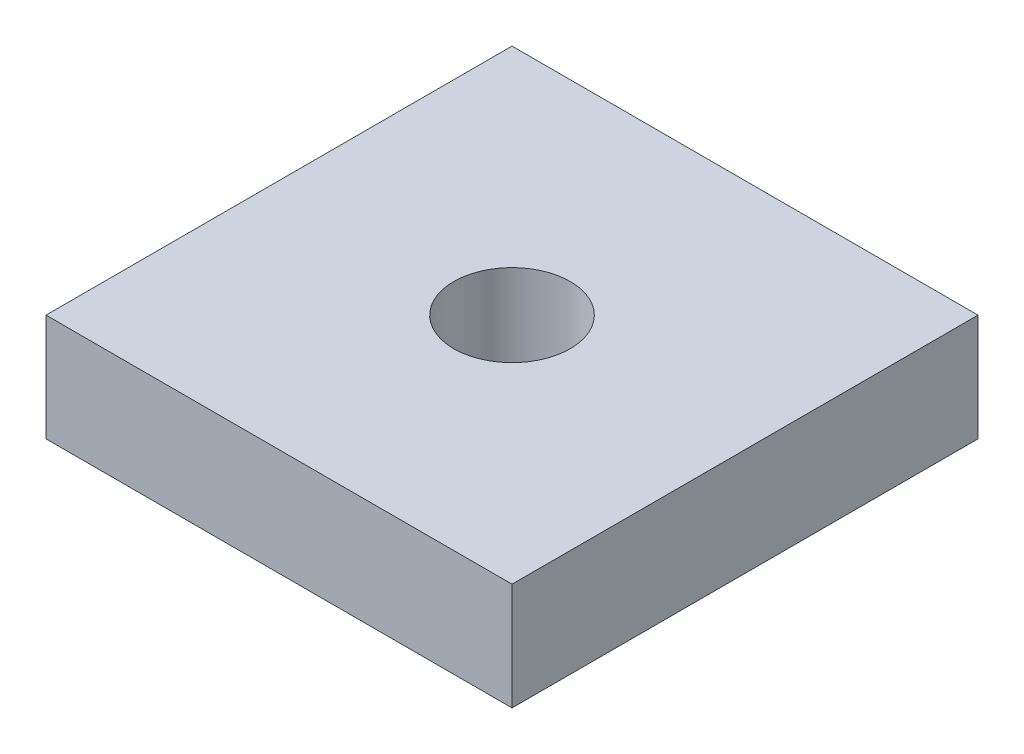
ISO-10303-21;
HEADER;
FILE_DESCRIPTION(('STEP AP214'),'2;1');
FILE_NAME('part.step','',(''),(''),'','','');
FILE_SCHEMA(('AUTOMOTIVE_DESIGN { 1 0 10303 214 1 1 1 1 }'));
ENDSEC;
DATA;
#1=APPLICATION_CONTEXT('core data for automotive mechanical design processes');
#2=APPLICATION_PROTOCOL_DEFINITION('international standard','automotive_design',2000,#1);
#3=PRODUCT_CONTEXT('',#1,'mechanical');
#4=PRODUCT('Part','Part','',(#3));
#5=PRODUCT_RELATED_PRODUCT_CATEGORY('part','',(#4));
#6=PRODUCT_DEFINITION_FORMATION('','',#4);
#7=PRODUCT_DEFINITION_CONTEXT('part definition',#1,'design');
#8=PRODUCT_DEFINITION('design','',#6,#7);
#9=PRODUCT_DEFINITION_SHAPE('','',#8);
#10=(LENGTH_UNIT() NAMED_UNIT(*) SI_UNIT(.MILLI.,.METRE.));
#11=(NAMED_UNIT(*) PLANE_ANGLE_UNIT() SI_UNIT($,.RADIAN.));
#12=(NAMED_UNIT(*) SI_UNIT($,.STERADIAN.) SOLID_ANGLE_UNIT());
#13=UNCERTAINTY_MEASURE_WITH_UNIT(LENGTH_MEASURE(1.E-05),#10,'distance_accuracy_value','');
#14=(GEOMETRIC_REPRESENTATION_CONTEXT(3) GLOBAL_UNCERTAINTY_ASSIGNED_CONTEXT((#13)) GLOBAL_UNIT_ASSIGNED_CONTEXT((#10,
#11,#12)) REPRESENTATION_CONTEXT('',''));
#15=CARTESIAN_POINT('',(0.,0.,0.));
#16=DIRECTION('',(0.,0.,1.));
#17=DIRECTION('',(1.,0.,0.));
#18=AXIS2_PLACEMENT_3D('',#15,#16,#17);
#19=CARTESIAN_POINT('',(0.,8.763,-38.1));
#20=DIRECTION('',(0.,-1.,0.));
#21=DIRECTION('',(0.,0.,-1.));
#22=AXIS2_PLACEMENT_3D('',#19,#20,#21);
#23=PLANE('',#22);
#24=DIRECTION('',(0.,0.,1.));
#25=VECTOR('',#24,1.);
#26=CARTESIAN_POINT('',(0.,8.763,0.));
#27=LINE('',#26,#25);
#28=CARTESIAN_POINT('',(0.,8.763,-38.1));
#29=VERTEX_POINT('',#28);
#30=CARTESIAN_POINT('',(0.,8.763,0.));
#31=VERTEX_POINT('',#30);
#32=EDGE_CURVE('E84',#29,#31,#27,.T.);
#33=ORIENTED_EDGE('',*,*,#32,.T.);
#34=DIRECTION('',(1.,0.,0.));
#35=VECTOR('',#34,1.);
#36=CARTESIAN_POINT('',(0.,8.763,0.));
#37=LINE('',#36,#35);
#38=CARTESIAN_POINT('',(38.1,8.763,0.));
#39=VERTEX_POINT('',#38);
#40=EDGE_CURVE('E79',#31,#39,#37,.T.);
#41=ORIENTED_EDGE('',*,*,#40,.T.);
#42=DIRECTION('',(0.,0.,-1.));
#43=VECTOR('',#42,1.);
#44=CARTESIAN_POINT('',(38.1,8.763,0.));
#45=LINE('',#44,#43);
#46=CARTESIAN_POINT('',(38.1,8.763,-38.1));
#47=VERTEX_POINT('',#46);
#48=EDGE_CURVE('E82',#39,#47,#45,.T.);
#49=ORIENTED_EDGE('',*,*,#48,.T.);
#50=DIRECTION('',(-1.,0.,0.));
#51=VECTOR('',#50,1.);
#52=CARTESIAN_POINT('',(0.,8.763,-38.1));
#53=LINE('',#52,#51);
#54=EDGE_CURVE('E49',#47,#29,#53,.T.);
#55=ORIENTED_EDGE('',*,*,#54,.T.);
#56=EDGE_LOOP('',(#33,#41,#49,#55));
#57=FACE_BOUND('',#56,.T.);
#58=CARTESIAN_POINT('',(19.05,8.763,-19.05));
#59=DIRECTION('',(0.,1.,0.));
#60=DIRECTION('',(0.,0.,1.));
#61=AXIS2_PLACEMENT_3D('',#58,#59,#60);
#62=CIRCLE('',#61,4.7625);
#63=CARTESIAN_POINT('',(19.05,8.763,-14.2875));
#64=VERTEX_POINT('',#63);
#65=EDGE_CURVE('E99',#64,#64,#62,.T.);
#66=ORIENTED_EDGE('',*,*,#65,.F.);
#67=EDGE_LOOP('',(#66));
#68=FACE_BOUND('',#67,.T.);
#69=ADVANCED_FACE('F32',(#57,#68),#23,.F.);
#70=CARTESIAN_POINT('',(0.,0.,-38.1));
#71=DIRECTION('',(0.,-1.,0.));
#72=DIRECTION('',(0.,0.,-1.));
#73=AXIS2_PLACEMENT_3D('',#70,#71,#72);
#74=PLANE('',#73);
#75=DIRECTION('',(0.,0.,1.));
#76=VECTOR('',#75,1.);
#77=CARTESIAN_POINT('',(0.,0.,0.));
#78=LINE('',#77,#76);
#79=CARTESIAN_POINT('',(0.,0.,-38.1));
#80=VERTEX_POINT('',#79);
#81=CARTESIAN_POINT('',(0.,0.,0.));
#82=VERTEX_POINT('',#81);
#83=EDGE_CURVE('E96',#80,#82,#78,.T.);
#84=ORIENTED_EDGE('',*,*,#83,.F.);
#85=DIRECTION('',(-1.,0.,0.));
#86=VECTOR('',#85,1.);
#87=CARTESIAN_POINT('',(0.,0.,-38.1));
#88=LINE('',#87,#86);
#89=CARTESIAN_POINT('',(38.1,0.,-38.1));
#90=VERTEX_POINT('',#89);
#91=EDGE_CURVE('E72',#90,#80,#88,.T.);
#92=ORIENTED_EDGE('',*,*,#91,.F.);
#93=DIRECTION('',(0.,0.,-1.));
#94=VECTOR('',#93,1.);
#95=CARTESIAN_POINT('',(38.1,0.,0.));
#96=LINE('',#95,#94);
#97=CARTESIAN_POINT('',(38.1,0.,0.));
#98=VERTEX_POINT('',#97);
#99=EDGE_CURVE('E66',#98,#90,#96,.T.);
#100=ORIENTED_EDGE('',*,*,#99,.F.);
#101=DIRECTION('',(1.,0.,0.));
#102=VECTOR('',#101,1.);
#103=CARTESIAN_POINT('',(0.,0.,0.));
#104=LINE('',#103,#102);
#105=EDGE_CURVE('E88',#82,#98,#104,.T.);
#106=ORIENTED_EDGE('',*,*,#105,.F.);
#107=EDGE_LOOP('',(#84,#92,#100,#106));
#108=FACE_BOUND('',#107,.T.);
#109=CARTESIAN_POINT('',(19.05,0.,-19.05));
#110=DIRECTION('',(0.,1.,0.));
#111=DIRECTION('',(0.,0.,1.));
#112=AXIS2_PLACEMENT_3D('',#109,#110,#111);
#113=CIRCLE('',#112,4.7625);
#114=CARTESIAN_POINT('',(19.05,0.,-14.2875));
#115=VERTEX_POINT('',#114);
#116=EDGE_CURVE('E111',#115,#115,#113,.T.);
#117=ORIENTED_EDGE('',*,*,#116,.T.);
#118=EDGE_LOOP('',(#117));
#119=FACE_BOUND('',#118,.T.);
#120=ADVANCED_FACE('F107',(#108,#119),#74,.T.);
#121=CARTESIAN_POINT('',(0.,8.763,0.));
#122=DIRECTION('',(1.,0.,0.));
#123=DIRECTION('',(0.,0.,-1.));
#124=AXIS2_PLACEMENT_3D('',#121,#122,#123);
#125=PLANE('',#124);
#126=ORIENTED_EDGE('',*,*,#83,.T.);
#127=DIRECTION('',(0.,-1.,0.));
#128=VECTOR('',#127,1.);
#129=CARTESIAN_POINT('',(0.,8.763,0.));
#130=LINE('',#129,#128);
#131=EDGE_CURVE('E11',#31,#82,#130,.T.);
#132=ORIENTED_EDGE('',*,*,#131,.F.);
#133=ORIENTED_EDGE('',*,*,#32,.F.);
#134=DIRECTION('',(0.,-1.,0.));
#135=VECTOR('',#134,1.);
#136=CARTESIAN_POINT('',(0.,8.763,-38.1));
#137=LINE('',#136,#135);
#138=EDGE_CURVE('E92',#29,#80,#137,.T.);
#139=ORIENTED_EDGE('',*,*,#138,.T.);
#140=EDGE_LOOP('',(#126,#132,#133,#139));
#141=FACE_BOUND('',#140,.T.);
#142=ADVANCED_FACE('F34',(#141),#125,.F.);
#143=CARTESIAN_POINT('',(0.,8.763,0.));
#144=DIRECTION('',(0.,0.,-1.));
#145=DIRECTION('',(-1.,0.,0.));
#146=AXIS2_PLACEMENT_3D('',#143,#144,#145);
#147=PLANE('',#146);
#148=ORIENTED_EDGE('',*,*,#105,.T.);
#149=DIRECTION('',(0.,-1.,0.));
#150=VECTOR('',#149,1.);
#151=CARTESIAN_POINT('',(38.1,8.763,0.));
#152=LINE('',#151,#150);
#153=EDGE_CURVE('E41',#39,#98,#152,.T.);
#154=ORIENTED_EDGE('',*,*,#153,.F.);
#155=ORIENTED_EDGE('',*,*,#40,.F.);
#156=ORIENTED_EDGE('',*,*,#131,.T.);
#157=EDGE_LOOP('',(#148,#154,#155,#156));
#158=FACE_BOUND('',#157,.T.);
#159=ADVANCED_FACE('F87',(#158),#147,.F.);
#160=CARTESIAN_POINT('',(38.1,8.763,0.));
#161=DIRECTION('',(-1.,0.,0.));
#162=DIRECTION('',(0.,0.,1.));
#163=AXIS2_PLACEMENT_3D('',#160,#161,#162);
#164=PLANE('',#163);
#165=ORIENTED_EDGE('',*,*,#99,.T.);
#166=DIRECTION('',(0.,-1.,0.));
#167=VECTOR('',#166,1.);
#168=CARTESIAN_POINT('',(38.1,8.763,-38.1));
#169=LINE('',#168,#167);
#170=EDGE_CURVE('E89',#47,#90,#169,.T.);
#171=ORIENTED_EDGE('',*,*,#170,.F.);
#172=ORIENTED_EDGE('',*,*,#48,.F.);
#173=ORIENTED_EDGE('',*,*,#153,.T.);
#174=EDGE_LOOP('',(#165,#171,#172,#173));
#175=FACE_BOUND('',#174,.T.);
#176=ADVANCED_FACE('F90',(#175),#164,.F.);
#177=CARTESIAN_POINT('',(0.,8.763,-38.1));
#178=DIRECTION('',(0.,0.,1.));
#179=DIRECTION('',(1.,0.,0.));
#180=AXIS2_PLACEMENT_3D('',#177,#178,#179);
#181=PLANE('',#180);
#182=ORIENTED_EDGE('',*,*,#91,.T.);
#183=ORIENTED_EDGE('',*,*,#138,.F.);
#184=ORIENTED_EDGE('',*,*,#54,.F.);
#185=ORIENTED_EDGE('',*,*,#170,.T.);
#186=EDGE_LOOP('',(#182,#183,#184,#185));
#187=FACE_BOUND('',#186,.T.);
#188=ADVANCED_FACE('F104',(#187),#181,.F.);
#189=CARTESIAN_POINT('',(19.05,8.763,-19.05));
#190=DIRECTION('',(0.,-1.,0.));
#191=DIRECTION('',(0.,0.,-1.));
#192=AXIS2_PLACEMENT_3D('',#189,#190,#191);
#193=CYLINDRICAL_SURFACE('',#192,4.7625);
#194=ORIENTED_EDGE('',*,*,#65,.T.);
#195=EDGE_LOOP('',(#194));
#196=FACE_BOUND('',#195,.T.);
#197=ORIENTED_EDGE('',*,*,#116,.F.);
#198=EDGE_LOOP('',(#197));
#199=FACE_BOUND('',#198,.T.);
#200=ADVANCED_FACE('F117',(#196,#199),#193,.F.);
#201=CLOSED_SHELL('',(#69,#120,#142,#159,#176,#188,#200));
#202=MANIFOLD_SOLID_BREP('B2',#201);
#203=ADVANCED_BREP_SHAPE_REPRESENTATION('',(#18,#202),#14);
#204=SHAPE_DEFINITION_REPRESENTATION(#9,#203);
ENDSEC;
END-ISO-10303-21;
